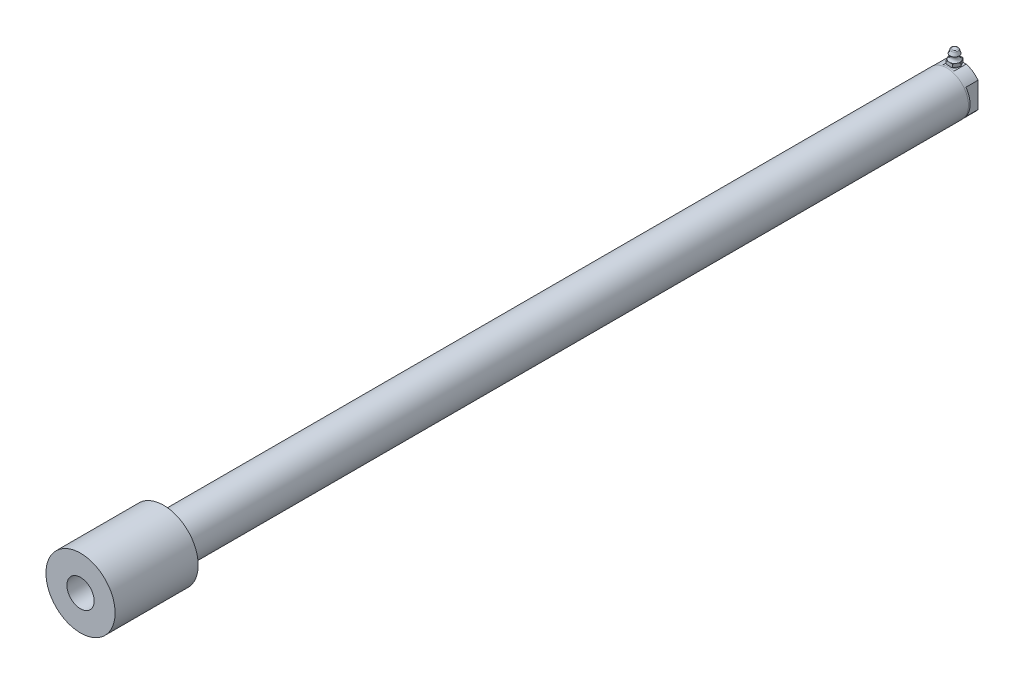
ISO-10303-21;
HEADER;
FILE_DESCRIPTION(('STEP AP214'),'2;1');
FILE_NAME('part.step','',(''),(''),'','','');
FILE_SCHEMA(('AUTOMOTIVE_DESIGN { 1 0 10303 214 1 1 1 1 }'));
ENDSEC;
DATA;
#1=APPLICATION_CONTEXT('core data for automotive mechanical design processes');
#2=APPLICATION_PROTOCOL_DEFINITION('international standard','automotive_design',2000,#1);
#3=PRODUCT_CONTEXT('',#1,'mechanical');
#4=PRODUCT('Part','Part','',(#3));
#5=PRODUCT_RELATED_PRODUCT_CATEGORY('part','',(#4));
#6=PRODUCT_DEFINITION_FORMATION('','',#4);
#7=PRODUCT_DEFINITION_CONTEXT('part definition',#1,'design');
#8=PRODUCT_DEFINITION('design','',#6,#7);
#9=PRODUCT_DEFINITION_SHAPE('','',#8);
#10=(LENGTH_UNIT() NAMED_UNIT(*) SI_UNIT(.MILLI.,.METRE.));
#11=(NAMED_UNIT(*) PLANE_ANGLE_UNIT() SI_UNIT($,.RADIAN.));
#12=(NAMED_UNIT(*) SI_UNIT($,.STERADIAN.) SOLID_ANGLE_UNIT());
#13=UNCERTAINTY_MEASURE_WITH_UNIT(LENGTH_MEASURE(1.E-05),#10,'distance_accuracy_value','');
#14=(GEOMETRIC_REPRESENTATION_CONTEXT(3) GLOBAL_UNCERTAINTY_ASSIGNED_CONTEXT((#13)) GLOBAL_UNIT_ASSIGNED_CONTEXT((#10,
#11,#12)) REPRESENTATION_CONTEXT('',''));
#15=CARTESIAN_POINT('',(0.,0.,0.));
#16=DIRECTION('',(0.,0.,1.));
#17=DIRECTION('',(1.,0.,0.));
#18=AXIS2_PLACEMENT_3D('',#15,#16,#17);
#19=CARTESIAN_POINT('',(0.,0.,10.16));
#20=DIRECTION('',(0.,0.,-1.));
#21=DIRECTION('',(-1.,0.,0.));
#22=AXIS2_PLACEMENT_3D('',#19,#20,#21);
#23=PLANE('',#22);
#24=CARTESIAN_POINT('',(0.,0.,10.16));
#25=DIRECTION('',(0.,0.,-1.));
#26=DIRECTION('',(-1.,0.,0.));
#27=AXIS2_PLACEMENT_3D('',#24,#25,#26);
#28=CIRCLE('',#27,15.8496);
#29=CARTESIAN_POINT('',(-15.8496,0.,10.16));
#30=VERTEX_POINT('',#29);
#31=EDGE_CURVE('E242',#30,#30,#28,.T.);
#32=ORIENTED_EDGE('',*,*,#31,.T.);
#33=EDGE_LOOP('',(#32));
#34=FACE_BOUND('',#33,.T.);
#35=CARTESIAN_POINT('',(0.,0.,10.16));
#36=DIRECTION('',(0.,0.,-1.));
#37=DIRECTION('',(0.,1.,0.));
#38=AXIS2_PLACEMENT_3D('',#35,#36,#37);
#39=CIRCLE('',#38,15.7607);
#40=CARTESIAN_POINT('',(0.,15.7607,10.16));
#41=VERTEX_POINT('',#40);
#42=EDGE_CURVE('E245',#41,#41,#39,.T.);
#43=ORIENTED_EDGE('',*,*,#42,.F.);
#44=EDGE_LOOP('',(#43));
#45=FACE_BOUND('',#44,.T.);
#46=ADVANCED_FACE('F16',(#34,#45),#23,.T.);
#47=CARTESIAN_POINT('',(0.,0.,585.2922));
#48=DIRECTION('',(0.,0.,1.));
#49=DIRECTION('',(1.,0.,0.));
#50=AXIS2_PLACEMENT_3D('',#47,#48,#49);
#51=PLANE('',#50);
#52=CARTESIAN_POINT('',(0.,0.,585.2922));
#53=DIRECTION('',(0.,0.,1.));
#54=DIRECTION('',(1.,0.,0.));
#55=AXIS2_PLACEMENT_3D('',#52,#53,#54);
#56=CIRCLE('',#55,15.8496);
#57=CARTESIAN_POINT('',(15.8496,0.,585.2922));
#58=VERTEX_POINT('',#57);
#59=EDGE_CURVE('E237',#58,#58,#56,.F.);
#60=ORIENTED_EDGE('',*,*,#59,.F.);
#61=EDGE_LOOP('',(#60));
#62=FACE_BOUND('',#61,.T.);
#63=CARTESIAN_POINT('',(0.,0.,585.2922));
#64=DIRECTION('',(0.,0.,1.));
#65=DIRECTION('',(1.,0.,0.));
#66=AXIS2_PLACEMENT_3D('',#63,#64,#65);
#67=CIRCLE('',#66,25.4);
#68=CARTESIAN_POINT('',(25.4,0.,585.2922));
#69=VERTEX_POINT('',#68);
#70=EDGE_CURVE('E233',#69,#69,#67,.T.);
#71=ORIENTED_EDGE('',*,*,#70,.F.);
#72=EDGE_LOOP('',(#71));
#73=FACE_BOUND('',#72,.T.);
#74=ADVANCED_FACE('F389',(#62,#73),#51,.F.);
#75=CARTESIAN_POINT('',(0.,0.,646.28014));
#76=DIRECTION('',(0.,0.,-1.));
#77=DIRECTION('',(-1.,0.,0.));
#78=AXIS2_PLACEMENT_3D('',#75,#76,#77);
#79=CYLINDRICAL_SURFACE('',#78,25.4);
#80=CARTESIAN_POINT('',(0.,0.,646.28014));
#81=DIRECTION('',(0.,0.,1.));
#82=DIRECTION('',(1.,0.,0.));
#83=AXIS2_PLACEMENT_3D('',#80,#81,#82);
#84=CIRCLE('',#83,25.4);
#85=CARTESIAN_POINT('',(25.4,0.,646.28014));
#86=VERTEX_POINT('',#85);
#87=EDGE_CURVE('E234',#86,#86,#84,.T.);
#88=ORIENTED_EDGE('',*,*,#87,.F.);
#89=EDGE_LOOP('',(#88));
#90=FACE_BOUND('',#89,.T.);
#91=ORIENTED_EDGE('',*,*,#70,.T.);
#92=EDGE_LOOP('',(#91));
#93=FACE_BOUND('',#92,.T.);
#94=ADVANCED_FACE('F387',(#90,#93),#79,.T.);
#95=CARTESIAN_POINT('',(0.,0.,646.28014));
#96=DIRECTION('',(0.,0.,1.));
#97=DIRECTION('',(1.,0.,0.));
#98=AXIS2_PLACEMENT_3D('',#95,#96,#97);
#99=PLANE('',#98);
#100=CARTESIAN_POINT('',(0.,0.,646.28014));
#101=DIRECTION('',(0.,0.,1.));
#102=DIRECTION('',(1.,0.,0.));
#103=AXIS2_PLACEMENT_3D('',#100,#101,#102);
#104=CIRCLE('',#103,10.);
#105=CARTESIAN_POINT('',(10.,0.,646.28014));
#106=VERTEX_POINT('',#105);
#107=EDGE_CURVE('E227',#106,#106,#104,.T.);
#108=ORIENTED_EDGE('',*,*,#107,.F.);
#109=EDGE_LOOP('',(#108));
#110=FACE_BOUND('',#109,.T.);
#111=ORIENTED_EDGE('',*,*,#87,.T.);
#112=EDGE_LOOP('',(#111));
#113=FACE_BOUND('',#112,.T.);
#114=ADVANCED_FACE('F384',(#110,#113),#99,.T.);
#115=CARTESIAN_POINT('',(0.,0.,585.2922));
#116=DIRECTION('',(0.,0.,-1.));
#117=DIRECTION('',(-1.,0.,0.));
#118=AXIS2_PLACEMENT_3D('',#115,#116,#117);
#119=CYLINDRICAL_SURFACE('',#118,15.8496);
#120=ORIENTED_EDGE('',*,*,#59,.T.);
#121=EDGE_LOOP('',(#120));
#122=FACE_BOUND('',#121,.T.);
#123=ORIENTED_EDGE('',*,*,#31,.F.);
#124=EDGE_LOOP('',(#123));
#125=FACE_BOUND('',#124,.T.);
#126=ADVANCED_FACE('F382',(#122,#125),#119,.T.);
#127=CARTESIAN_POINT('',(0.,0.,77.3303));
#128=DIRECTION('',(0.,0.,-1.));
#129=DIRECTION('',(-1.,0.,0.));
#130=AXIS2_PLACEMENT_3D('',#127,#128,#129);
#131=PLANE('',#130);
#132=CARTESIAN_POINT('',(0.,0.,77.3303));
#133=DIRECTION('',(0.,0.,-1.));
#134=DIRECTION('',(-1.,0.,0.));
#135=AXIS2_PLACEMENT_3D('',#132,#133,#134);
#136=CIRCLE('',#135,10.);
#137=CARTESIAN_POINT('',(-10.,0.,77.3303));
#138=VERTEX_POINT('',#137);
#139=EDGE_CURVE('E230',#138,#138,#136,.F.);
#140=ORIENTED_EDGE('',*,*,#139,.T.);
#141=EDGE_LOOP('',(#140));
#142=FACE_BOUND('',#141,.T.);
#143=ADVANCED_FACE('F378',(#142),#131,.F.);
#144=CARTESIAN_POINT('',(0.,0.,-18.1242712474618));
#145=DIRECTION('',(0.,0.,1.));
#146=DIRECTION('',(1.,0.,0.));
#147=AXIS2_PLACEMENT_3D('',#144,#145,#146);
#148=CYLINDRICAL_SURFACE('',#147,10.);
#149=ORIENTED_EDGE('',*,*,#107,.T.);
#150=EDGE_LOOP('',(#149));
#151=FACE_BOUND('',#150,.T.);
#152=ORIENTED_EDGE('',*,*,#139,.F.);
#153=EDGE_LOOP('',(#152));
#154=FACE_BOUND('',#153,.T.);
#155=ADVANCED_FACE('F375',(#151,#154),#148,.F.);
#156=CARTESIAN_POINT('',(0.,0.,32.512));
#157=DIRECTION('',(0.,0.,-1.));
#158=DIRECTION('',(0.,1.,0.));
#159=AXIS2_PLACEMENT_3D('',#156,#157,#158);
#160=CONICAL_SURFACE('',#159,4.96062,1.02974425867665);
#161=CARTESIAN_POINT('',(0.,0.,35.4926412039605));
#162=VERTEX_POINT('',#161);
#163=VERTEX_LOOP('',#162);
#164=FACE_BOUND('',#163,.T.);
#165=CARTESIAN_POINT('',(0.,0.,32.512));
#166=DIRECTION('',(0.,0.,-1.));
#167=DIRECTION('',(0.,1.,0.));
#168=AXIS2_PLACEMENT_3D('',#165,#166,#167);
#169=CIRCLE('',#168,4.96062);
#170=CARTESIAN_POINT('',(0.,4.96062,32.512));
#171=VERTEX_POINT('',#170);
#172=EDGE_CURVE('E280',#171,#171,#169,.T.);
#173=ORIENTED_EDGE('',*,*,#172,.T.);
#174=EDGE_LOOP('',(#173));
#175=FACE_BOUND('',#174,.T.);
#176=ADVANCED_FACE('F318',(#164,#175),#160,.F.);
#177=CARTESIAN_POINT('',(0.,0.,0.));
#178=DIRECTION('',(0.,0.,-1.));
#179=DIRECTION('',(0.,1.,0.));
#180=AXIS2_PLACEMENT_3D('',#177,#178,#179);
#181=CYLINDRICAL_SURFACE('',#180,4.96062);
#182=ORIENTED_EDGE('',*,*,#172,.F.);
#183=EDGE_LOOP('',(#182));
#184=FACE_BOUND('',#183,.T.);
#185=CARTESIAN_POINT('',(0.,0.,0.));
#186=DIRECTION('',(0.,0.,-1.));
#187=DIRECTION('',(0.,1.,0.));
#188=AXIS2_PLACEMENT_3D('',#185,#186,#187);
#189=CIRCLE('',#188,4.96062);
#190=CARTESIAN_POINT('',(0.,4.96062,0.));
#191=VERTEX_POINT('',#190);
#192=EDGE_CURVE('E284',#191,#191,#189,.T.);
#193=ORIENTED_EDGE('',*,*,#192,.T.);
#194=EDGE_LOOP('',(#193));
#195=FACE_BOUND('',#194,.T.);
#196=ADVANCED_FACE('F307',(#184,#195),#181,.F.);
#197=CARTESIAN_POINT('',(0.,0.,8.89));
#198=DIRECTION('',(0.,0.,-1.));
#199=DIRECTION('',(0.,1.,0.));
#200=AXIS2_PLACEMENT_3D('',#197,#198,#199);
#201=PLANE('',#200);
#202=CARTESIAN_POINT('',(0.,0.,8.89));
#203=DIRECTION('',(0.,0.,-1.));
#204=DIRECTION('',(0.,1.,0.));
#205=AXIS2_PLACEMENT_3D('',#202,#203,#204);
#206=CIRCLE('',#205,15.7607);
#207=CARTESIAN_POINT('',(12.7,9.33325583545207,8.89));
#208=VERTEX_POINT('',#207);
#209=CARTESIAN_POINT('',(12.7,-9.33325583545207,8.89));
#210=VERTEX_POINT('',#209);
#211=EDGE_CURVE('E269',#208,#210,#206,.T.);
#212=ORIENTED_EDGE('',*,*,#211,.T.);
#213=DIRECTION('',(0.,1.,0.));
#214=VECTOR('',#213,1.);
#215=CARTESIAN_POINT('',(12.7,-9.33325583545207,8.89));
#216=LINE('',#215,#214);
#217=EDGE_CURVE('E271',#210,#208,#216,.T.);
#218=ORIENTED_EDGE('',*,*,#217,.T.);
#219=EDGE_LOOP('',(#212,#218));
#220=FACE_BOUND('',#219,.T.);
#221=ADVANCED_FACE('F305',(#220),#201,.T.);
#222=CARTESIAN_POINT('',(12.7,-9.33325583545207,8.89));
#223=DIRECTION('',(-1.,0.,0.));
#224=DIRECTION('',(0.,0.,1.));
#225=AXIS2_PLACEMENT_3D('',#222,#223,#224);
#226=PLANE('',#225);
#227=DIRECTION('',(0.,1.,0.));
#228=VECTOR('',#227,1.);
#229=CARTESIAN_POINT('',(12.7,-9.33325583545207,0.));
#230=LINE('',#229,#228);
#231=CARTESIAN_POINT('',(12.7,-9.33325583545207,0.));
#232=VERTEX_POINT('',#231);
#233=CARTESIAN_POINT('',(12.7,9.33325583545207,0.));
#234=VERTEX_POINT('',#233);
#235=EDGE_CURVE('E267',#232,#234,#230,.T.);
#236=ORIENTED_EDGE('',*,*,#235,.T.);
#237=DIRECTION('',(0.,0.,-1.));
#238=VECTOR('',#237,1.);
#239=CARTESIAN_POINT('',(12.7,9.33325583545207,8.89));
#240=LINE('',#239,#238);
#241=EDGE_CURVE('E277',#208,#234,#240,.T.);
#242=ORIENTED_EDGE('',*,*,#241,.F.);
#243=ORIENTED_EDGE('',*,*,#217,.F.);
#244=DIRECTION('',(0.,0.,-1.));
#245=VECTOR('',#244,1.);
#246=CARTESIAN_POINT('',(12.7,-9.33325583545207,8.89));
#247=LINE('',#246,#245);
#248=EDGE_CURVE('E274',#210,#232,#247,.T.);
#249=ORIENTED_EDGE('',*,*,#248,.T.);
#250=EDGE_LOOP('',(#236,#242,#243,#249));
#251=FACE_BOUND('',#250,.T.);
#252=ADVANCED_FACE('F299',(#251),#226,.F.);
#253=CARTESIAN_POINT('',(0.,0.,8.89));
#254=DIRECTION('',(0.,0.,-1.));
#255=DIRECTION('',(0.,1.,0.));
#256=AXIS2_PLACEMENT_3D('',#253,#254,#255);
#257=PLANE('',#256);
#258=CARTESIAN_POINT('',(0.,0.,8.89));
#259=DIRECTION('',(0.,0.,-1.));
#260=DIRECTION('',(0.,1.,0.));
#261=AXIS2_PLACEMENT_3D('',#258,#259,#260);
#262=CIRCLE('',#261,15.7607);
#263=CARTESIAN_POINT('',(-12.7,-9.33325583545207,8.89));
#264=VERTEX_POINT('',#263);
#265=CARTESIAN_POINT('',(-12.7,9.33325583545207,8.89));
#266=VERTEX_POINT('',#265);
#267=EDGE_CURVE('E258',#264,#266,#262,.T.);
#268=ORIENTED_EDGE('',*,*,#267,.T.);
#269=DIRECTION('',(0.,-1.,0.));
#270=VECTOR('',#269,1.);
#271=CARTESIAN_POINT('',(-12.7,-9.33325583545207,8.89));
#272=LINE('',#271,#270);
#273=EDGE_CURVE('E260',#266,#264,#272,.T.);
#274=ORIENTED_EDGE('',*,*,#273,.T.);
#275=EDGE_LOOP('',(#268,#274));
#276=FACE_BOUND('',#275,.T.);
#277=ADVANCED_FACE('F316',(#276),#257,.T.);
#278=CARTESIAN_POINT('',(-12.7,-9.33325583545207,8.89));
#279=DIRECTION('',(1.,0.,0.));
#280=DIRECTION('',(0.,0.,-1.));
#281=AXIS2_PLACEMENT_3D('',#278,#279,#280);
#282=PLANE('',#281);
#283=DIRECTION('',(0.,-1.,0.));
#284=VECTOR('',#283,1.);
#285=CARTESIAN_POINT('',(-12.7,-9.33325583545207,0.));
#286=LINE('',#285,#284);
#287=CARTESIAN_POINT('',(-12.7,9.33325583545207,0.));
#288=VERTEX_POINT('',#287);
#289=CARTESIAN_POINT('',(-12.7,-9.33325583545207,0.));
#290=VERTEX_POINT('',#289);
#291=EDGE_CURVE('E255',#288,#290,#286,.T.);
#292=ORIENTED_EDGE('',*,*,#291,.T.);
#293=DIRECTION('',(0.,0.,-1.));
#294=VECTOR('',#293,1.);
#295=CARTESIAN_POINT('',(-12.7,-9.33325583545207,8.89));
#296=LINE('',#295,#294);
#297=EDGE_CURVE('E264',#264,#290,#296,.T.);
#298=ORIENTED_EDGE('',*,*,#297,.F.);
#299=ORIENTED_EDGE('',*,*,#273,.F.);
#300=DIRECTION('',(0.,0.,-1.));
#301=VECTOR('',#300,1.);
#302=CARTESIAN_POINT('',(-12.7,9.33325583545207,8.89));
#303=LINE('',#302,#301);
#304=EDGE_CURVE('E79',#266,#288,#303,.T.);
#305=ORIENTED_EDGE('',*,*,#304,.T.);
#306=EDGE_LOOP('',(#292,#298,#299,#305));
#307=FACE_BOUND('',#306,.T.);
#308=ADVANCED_FACE('F309',(#307),#282,.F.);
#309=CARTESIAN_POINT('',(0.,0.,0.));
#310=DIRECTION('',(0.,0.,-1.));
#311=DIRECTION('',(0.,1.,0.));
#312=AXIS2_PLACEMENT_3D('',#309,#310,#311);
#313=PLANE('',#312);
#314=DIRECTION('',(-1.,0.,0.));
#315=VECTOR('',#314,1.);
#316=CARTESIAN_POINT('',(4.01771881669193,15.24,0.));
#317=LINE('',#316,#315);
#318=CARTESIAN_POINT('',(4.01771881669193,15.24,0.));
#319=VERTEX_POINT('',#318);
#320=CARTESIAN_POINT('',(-4.01771881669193,15.24,0.));
#321=VERTEX_POINT('',#320);
#322=EDGE_CURVE('E252',#319,#321,#317,.T.);
#323=ORIENTED_EDGE('',*,*,#322,.F.);
#324=CARTESIAN_POINT('',(0.,0.,0.));
#325=DIRECTION('',(0.,0.,-1.));
#326=DIRECTION('',(0.,1.,0.));
#327=AXIS2_PLACEMENT_3D('',#324,#325,#326);
#328=CIRCLE('',#327,15.7607);
#329=EDGE_CURVE('E286',#319,#234,#328,.T.);
#330=ORIENTED_EDGE('',*,*,#329,.T.);
#331=ORIENTED_EDGE('',*,*,#235,.F.);
#332=EDGE_CURVE('E287',#232,#290,#328,.T.);
#333=ORIENTED_EDGE('',*,*,#332,.T.);
#334=ORIENTED_EDGE('',*,*,#291,.F.);
#335=EDGE_CURVE('E289',#288,#321,#328,.T.);
#336=ORIENTED_EDGE('',*,*,#335,.T.);
#337=EDGE_LOOP('',(#323,#330,#331,#333,#334,#336));
#338=FACE_BOUND('',#337,.T.);
#339=ORIENTED_EDGE('',*,*,#192,.F.);
#340=EDGE_LOOP('',(#339));
#341=FACE_BOUND('',#340,.T.);
#342=ADVANCED_FACE('F295',(#338,#341),#313,.T.);
#343=CARTESIAN_POINT('',(-4.01771881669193,15.24,8.89));
#344=DIRECTION('',(0.,0.,-1.));
#345=DIRECTION('',(0.,1.,0.));
#346=AXIS2_PLACEMENT_3D('',#343,#344,#345);
#347=PLANE('',#346);
#348=CARTESIAN_POINT('',(0.,0.,8.89));
#349=DIRECTION('',(0.,0.,-1.));
#350=DIRECTION('',(0.,1.,0.));
#351=AXIS2_PLACEMENT_3D('',#348,#349,#350);
#352=CIRCLE('',#351,15.7607);
#353=CARTESIAN_POINT('',(4.01771881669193,15.24,8.89));
#354=VERTEX_POINT('',#353);
#355=CARTESIAN_POINT('',(-4.01771881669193,15.24,8.89));
#356=VERTEX_POINT('',#355);
#357=EDGE_CURVE('E20',#354,#356,#352,.F.);
#358=ORIENTED_EDGE('',*,*,#357,.F.);
#359=DIRECTION('',(-1.,0.,0.));
#360=VECTOR('',#359,1.);
#361=CARTESIAN_POINT('',(4.01771881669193,15.24,8.89));
#362=LINE('',#361,#360);
#363=EDGE_CURVE('E248',#354,#356,#362,.T.);
#364=ORIENTED_EDGE('',*,*,#363,.T.);
#365=EDGE_LOOP('',(#358,#364));
#366=FACE_BOUND('',#365,.T.);
#367=ADVANCED_FACE('F402',(#366),#347,.T.);
#368=CARTESIAN_POINT('',(4.01771881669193,15.24,8.89));
#369=DIRECTION('',(0.,-1.,0.));
#370=DIRECTION('',(0.,0.,-1.));
#371=AXIS2_PLACEMENT_3D('',#368,#369,#370);
#372=PLANE('',#371);
#373=CARTESIAN_POINT('',(0.,15.24,4.445));
#374=DIRECTION('',(0.,-1.,0.));
#375=DIRECTION('',(1.,0.,0.));
#376=AXIS2_PLACEMENT_3D('',#373,#374,#375);
#377=CIRCLE('',#376,3.21504291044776);
#378=CARTESIAN_POINT('',(3.21504291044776,15.24,4.445));
#379=VERTEX_POINT('',#378);
#380=EDGE_CURVE('E10',#379,#379,#377,.F.);
#381=ORIENTED_EDGE('',*,*,#380,.F.);
#382=EDGE_LOOP('',(#381));
#383=FACE_BOUND('',#382,.T.);
#384=ORIENTED_EDGE('',*,*,#322,.T.);
#385=DIRECTION('',(0.,0.,-1.));
#386=VECTOR('',#385,1.);
#387=CARTESIAN_POINT('',(-4.01771881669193,15.24,8.89));
#388=LINE('',#387,#386);
#389=EDGE_CURVE('E251',#356,#321,#388,.T.);
#390=ORIENTED_EDGE('',*,*,#389,.F.);
#391=ORIENTED_EDGE('',*,*,#363,.F.);
#392=DIRECTION('',(0.,0.,-1.));
#393=VECTOR('',#392,1.);
#394=CARTESIAN_POINT('',(4.01771881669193,15.24,8.89));
#395=LINE('',#394,#393);
#396=EDGE_CURVE('E86',#354,#319,#395,.T.);
#397=ORIENTED_EDGE('',*,*,#396,.T.);
#398=EDGE_LOOP('',(#384,#390,#391,#397));
#399=FACE_BOUND('',#398,.T.);
#400=ADVANCED_FACE('F336',(#383,#399),#372,.F.);
#401=CARTESIAN_POINT('',(0.,0.,10.16));
#402=DIRECTION('',(0.,0.,-1.));
#403=DIRECTION('',(0.,1.,0.));
#404=AXIS2_PLACEMENT_3D('',#401,#402,#403);
#405=CYLINDRICAL_SURFACE('',#404,15.7607);
#406=ORIENTED_EDGE('',*,*,#396,.F.);
#407=ORIENTED_EDGE('',*,*,#357,.T.);
#408=ORIENTED_EDGE('',*,*,#389,.T.);
#409=ORIENTED_EDGE('',*,*,#335,.F.);
#410=ORIENTED_EDGE('',*,*,#304,.F.);
#411=ORIENTED_EDGE('',*,*,#267,.F.);
#412=ORIENTED_EDGE('',*,*,#297,.T.);
#413=ORIENTED_EDGE('',*,*,#332,.F.);
#414=ORIENTED_EDGE('',*,*,#248,.F.);
#415=ORIENTED_EDGE('',*,*,#211,.F.);
#416=ORIENTED_EDGE('',*,*,#241,.T.);
#417=ORIENTED_EDGE('',*,*,#329,.F.);
#418=EDGE_LOOP('',(#406,#407,#408,#409,#410,#411,#412,#413,#414,#415,#416,#417));
#419=FACE_BOUND('',#418,.T.);
#420=ORIENTED_EDGE('',*,*,#42,.T.);
#421=EDGE_LOOP('',(#420));
#422=FACE_BOUND('',#421,.T.);
#423=ADVANCED_FACE('F18',(#419,#422),#405,.T.);
#424=CARTESIAN_POINT('',(0.,25.4,4.445));
#425=DIRECTION('',(0.,1.,0.));
#426=DIRECTION('',(0.,0.,1.));
#427=AXIS2_PLACEMENT_3D('',#424,#425,#426);
#428=PLANE('',#427);
#429=CARTESIAN_POINT('',(0.,25.4,4.445));
#430=DIRECTION('',(0.,1.,0.));
#431=DIRECTION('',(0.,0.,1.));
#432=AXIS2_PLACEMENT_3D('',#429,#430,#431);
#433=CIRCLE('',#432,1.7474960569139);
#434=CARTESIAN_POINT('',(0.,25.4,6.1924960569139));
#435=VERTEX_POINT('',#434);
#436=EDGE_CURVE('E26',#435,#435,#433,.T.);
#437=ORIENTED_EDGE('',*,*,#436,.T.);
#438=EDGE_LOOP('',(#437));
#439=FACE_BOUND('',#438,.T.);
#440=ADVANCED_FACE('F323',(#439),#428,.T.);
#441=CARTESIAN_POINT('',(0.,24.638,4.445));
#442=DIRECTION('',(0.,1.,0.));
#443=DIRECTION('',(0.,0.,1.));
#444=AXIS2_PLACEMENT_3D('',#441,#442,#443);
#445=TOROIDAL_SURFACE('',#444,1.7474960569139,0.762);
#446=ORIENTED_EDGE('',*,*,#436,.F.);
#447=EDGE_LOOP('',(#446));
#448=FACE_BOUND('',#447,.T.);
#449=CARTESIAN_POINT('',(0.,24.8923915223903,4.445));
#450=DIRECTION('',(0.,1.,0.));
#451=DIRECTION('',(0.,0.,1.));
#452=AXIS2_PLACEMENT_3D('',#449,#450,#451);
#453=CIRCLE('',#452,2.46577800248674);
#454=CARTESIAN_POINT('',(0.,24.8923915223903,6.91077800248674));
#455=VERTEX_POINT('',#454);
#456=EDGE_CURVE('E222',#455,#455,#453,.F.);
#457=ORIENTED_EDGE('',*,*,#456,.F.);
#458=EDGE_LOOP('',(#457));
#459=FACE_BOUND('',#458,.T.);
#460=ADVANCED_FACE('F325',(#448,#459),#445,.T.);
#461=CARTESIAN_POINT('',(0.,22.352,4.445));
#462=DIRECTION('',(0.,-1.,0.));
#463=DIRECTION('',(0.,0.,-1.));
#464=AXIS2_PLACEMENT_3D('',#461,#462,#463);
#465=CONICAL_SURFACE('',#464,3.3655,0.340381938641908);
#466=ORIENTED_EDGE('',*,*,#456,.T.);
#467=EDGE_LOOP('',(#466));
#468=FACE_BOUND('',#467,.T.);
#469=CARTESIAN_POINT('',(0.,22.352,4.445));
#470=DIRECTION('',(0.,-1.,0.));
#471=DIRECTION('',(0.,0.,-1.));
#472=AXIS2_PLACEMENT_3D('',#469,#470,#471);
#473=CIRCLE('',#472,3.3655);
#474=CARTESIAN_POINT('',(0.,22.352,1.0795));
#475=VERTEX_POINT('',#474);
#476=EDGE_CURVE('E175',#475,#475,#473,.T.);
#477=ORIENTED_EDGE('',*,*,#476,.F.);
#478=EDGE_LOOP('',(#477));
#479=FACE_BOUND('',#478,.T.);
#480=ADVANCED_FACE('F333',(#468,#479),#465,.T.);
#481=CARTESIAN_POINT('',(0.,20.7536902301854,4.445));
#482=DIRECTION('',(0.,-1.,0.));
#483=DIRECTION('',(0.,0.,-1.));
#484=AXIS2_PLACEMENT_3D('',#481,#482,#483);
#485=TOROIDAL_SURFACE('',#484,5.20693450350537,2.43833450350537);
#486=ORIENTED_EDGE('',*,*,#476,.T.);
#487=EDGE_LOOP('',(#486));
#488=FACE_BOUND('',#487,.T.);
#489=CARTESIAN_POINT('',(0.,18.653125,4.445));
#490=DIRECTION('',(0.,-1.,0.));
#491=DIRECTION('',(0.,0.,-1.));
#492=AXIS2_PLACEMENT_3D('',#489,#490,#491);
#493=CIRCLE('',#492,3.96875);
#494=CARTESIAN_POINT('',(0.,18.653125,0.47625));
#495=VERTEX_POINT('',#494);
#496=CARTESIAN_POINT('',(3.43703832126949,18.653125,2.460625));
#497=VERTEX_POINT('',#496);
#498=EDGE_CURVE('E35',#495,#497,#493,.T.);
#499=ORIENTED_EDGE('',*,*,#498,.F.);
#500=CARTESIAN_POINT('',(-3.43703832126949,18.653125,2.460625));
#501=VERTEX_POINT('',#500);
#502=EDGE_CURVE('E171',#501,#495,#493,.T.);
#503=ORIENTED_EDGE('',*,*,#502,.F.);
#504=CARTESIAN_POINT('',(-3.43703832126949,18.653125,6.429375));
#505=VERTEX_POINT('',#504);
#506=EDGE_CURVE('E170',#505,#501,#493,.T.);
#507=ORIENTED_EDGE('',*,*,#506,.F.);
#508=CARTESIAN_POINT('',(0.,18.653125,8.41375));
#509=VERTEX_POINT('',#508);
#510=EDGE_CURVE('E150',#509,#505,#493,.T.);
#511=ORIENTED_EDGE('',*,*,#510,.F.);
#512=CARTESIAN_POINT('',(3.43703832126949,18.653125,6.429375));
#513=VERTEX_POINT('',#512);
#514=EDGE_CURVE('E139',#513,#509,#493,.T.);
#515=ORIENTED_EDGE('',*,*,#514,.F.);
#516=EDGE_CURVE('E149',#497,#513,#493,.T.);
#517=ORIENTED_EDGE('',*,*,#516,.F.);
#518=EDGE_LOOP('',(#499,#503,#507,#511,#515,#517));
#519=FACE_BOUND('',#518,.T.);
#520=ADVANCED_FACE('F168',(#488,#519),#485,.F.);
#521=CARTESIAN_POINT('',(-2.29135888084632,18.653125,0.47625));
#522=DIRECTION('',(0.,1.,0.));
#523=DIRECTION('',(1.,0.,0.));
#524=AXIS2_PLACEMENT_3D('',#521,#522,#523);
#525=PLANE('',#524);
#526=ORIENTED_EDGE('',*,*,#506,.T.);
#527=DIRECTION('',(-0.5,0.,0.866025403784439));
#528=VECTOR('',#527,1.);
#529=CARTESIAN_POINT('',(-2.29135888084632,18.653125,0.47625));
#530=LINE('',#529,#528);
#531=CARTESIAN_POINT('',(-4.58271776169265,18.653125,4.445));
#532=VERTEX_POINT('',#531);
#533=EDGE_CURVE('E184',#501,#532,#530,.T.);
#534=ORIENTED_EDGE('',*,*,#533,.T.);
#535=DIRECTION('',(0.5,0.,0.866025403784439));
#536=VECTOR('',#535,1.);
#537=CARTESIAN_POINT('',(-4.58271776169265,18.653125,4.445));
#538=LINE('',#537,#536);
#539=EDGE_CURVE('E95',#532,#505,#538,.T.);
#540=ORIENTED_EDGE('',*,*,#539,.T.);
#541=EDGE_LOOP('',(#526,#534,#540));
#542=FACE_BOUND('',#541,.T.);
#543=ADVANCED_FACE('F344',(#542),#525,.T.);
#544=ORIENTED_EDGE('',*,*,#510,.T.);
#545=CARTESIAN_POINT('',(-2.29135888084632,18.653125,8.41375));
#546=VERTEX_POINT('',#545);
#547=EDGE_CURVE('E165',#505,#546,#538,.T.);
#548=ORIENTED_EDGE('',*,*,#547,.T.);
#549=DIRECTION('',(1.,0.,0.));
#550=VECTOR('',#549,1.);
#551=CARTESIAN_POINT('',(-2.29135888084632,18.653125,8.41375));
#552=LINE('',#551,#550);
#553=EDGE_CURVE('E157',#546,#509,#552,.T.);
#554=ORIENTED_EDGE('',*,*,#553,.T.);
#555=EDGE_LOOP('',(#544,#548,#554));
#556=FACE_BOUND('',#555,.T.);
#557=ADVANCED_FACE('F163',(#556),#525,.T.);
#558=ORIENTED_EDGE('',*,*,#514,.T.);
#559=CARTESIAN_POINT('',(2.29135888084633,18.653125,8.41375));
#560=VERTEX_POINT('',#559);
#561=EDGE_CURVE('E142',#509,#560,#552,.T.);
#562=ORIENTED_EDGE('',*,*,#561,.T.);
#563=DIRECTION('',(0.5,0.,-0.866025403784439));
#564=VECTOR('',#563,1.);
#565=CARTESIAN_POINT('',(2.29135888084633,18.653125,8.41375));
#566=LINE('',#565,#564);
#567=EDGE_CURVE('E145',#560,#513,#566,.T.);
#568=ORIENTED_EDGE('',*,*,#567,.T.);
#569=EDGE_LOOP('',(#558,#562,#568));
#570=FACE_BOUND('',#569,.T.);
#571=ADVANCED_FACE('F141',(#570),#525,.T.);
#572=ORIENTED_EDGE('',*,*,#516,.T.);
#573=CARTESIAN_POINT('',(4.58271776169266,18.653125,4.445));
#574=VERTEX_POINT('',#573);
#575=EDGE_CURVE('E167',#513,#574,#566,.T.);
#576=ORIENTED_EDGE('',*,*,#575,.T.);
#577=DIRECTION('',(-0.5,0.,-0.866025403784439));
#578=VECTOR('',#577,1.);
#579=CARTESIAN_POINT('',(4.58271776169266,18.653125,4.445));
#580=LINE('',#579,#578);
#581=EDGE_CURVE('E192',#574,#497,#580,.T.);
#582=ORIENTED_EDGE('',*,*,#581,.T.);
#583=EDGE_LOOP('',(#572,#576,#582));
#584=FACE_BOUND('',#583,.T.);
#585=ADVANCED_FACE('F651',(#584),#525,.T.);
#586=ORIENTED_EDGE('',*,*,#498,.T.);
#587=CARTESIAN_POINT('',(2.29135888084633,18.653125,0.47625));
#588=VERTEX_POINT('',#587);
#589=EDGE_CURVE('E191',#497,#588,#580,.T.);
#590=ORIENTED_EDGE('',*,*,#589,.T.);
#591=DIRECTION('',(-1.,0.,0.));
#592=VECTOR('',#591,1.);
#593=CARTESIAN_POINT('',(2.29135888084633,18.653125,0.47625));
#594=LINE('',#593,#592);
#595=EDGE_CURVE('E182',#588,#495,#594,.T.);
#596=ORIENTED_EDGE('',*,*,#595,.T.);
#597=EDGE_LOOP('',(#586,#590,#596));
#598=FACE_BOUND('',#597,.T.);
#599=ADVANCED_FACE('F658',(#598),#525,.T.);
#600=ORIENTED_EDGE('',*,*,#502,.T.);
#601=CARTESIAN_POINT('',(-2.29135888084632,18.653125,0.47625));
#602=VERTEX_POINT('',#601);
#603=EDGE_CURVE('E185',#495,#602,#594,.T.);
#604=ORIENTED_EDGE('',*,*,#603,.T.);
#605=EDGE_CURVE('E186',#602,#501,#530,.T.);
#606=ORIENTED_EDGE('',*,*,#605,.T.);
#607=EDGE_LOOP('',(#600,#604,#606));
#608=FACE_BOUND('',#607,.T.);
#609=ADVANCED_FACE('F347',(#608),#525,.T.);
#610=CARTESIAN_POINT('',(-2.29135888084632,18.653125,0.47625));
#611=DIRECTION('',(0.866025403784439,0.,0.5));
#612=DIRECTION('',(0.5,0.,-0.866025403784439));
#613=AXIS2_PLACEMENT_3D('',#610,#611,#612);
#614=PLANE('',#613);
#615=DIRECTION('',(-0.5,0.,0.866025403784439));
#616=VECTOR('',#615,1.);
#617=CARTESIAN_POINT('',(-2.29135888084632,16.271875,0.47625));
#618=LINE('',#617,#616);
#619=CARTESIAN_POINT('',(-2.29135888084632,16.271875,0.47625));
#620=VERTEX_POINT('',#619);
#621=CARTESIAN_POINT('',(-4.58271776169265,16.271875,4.445));
#622=VERTEX_POINT('',#621);
#623=EDGE_CURVE('E198',#620,#622,#618,.T.);
#624=ORIENTED_EDGE('',*,*,#623,.T.);
#625=DIRECTION('',(0.,-1.,0.));
#626=VECTOR('',#625,1.);
#627=CARTESIAN_POINT('',(-4.58271776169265,18.653125,4.445));
#628=LINE('',#627,#626);
#629=EDGE_CURVE('E216',#532,#622,#628,.T.);
#630=ORIENTED_EDGE('',*,*,#629,.F.);
#631=ORIENTED_EDGE('',*,*,#533,.F.);
#632=ORIENTED_EDGE('',*,*,#605,.F.);
#633=DIRECTION('',(0.,-1.,0.));
#634=VECTOR('',#633,1.);
#635=CARTESIAN_POINT('',(-2.29135888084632,18.653125,0.47625));
#636=LINE('',#635,#634);
#637=EDGE_CURVE('E219',#602,#620,#636,.T.);
#638=ORIENTED_EDGE('',*,*,#637,.T.);
#639=EDGE_LOOP('',(#624,#630,#631,#632,#638));
#640=FACE_BOUND('',#639,.T.);
#641=ADVANCED_FACE('F367',(#640),#614,.F.);
#642=CARTESIAN_POINT('',(-4.58271776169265,18.653125,4.445));
#643=DIRECTION('',(0.866025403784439,0.,-0.5));
#644=DIRECTION('',(-0.5,0.,-0.866025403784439));
#645=AXIS2_PLACEMENT_3D('',#642,#643,#644);
#646=PLANE('',#645);
#647=DIRECTION('',(0.5,0.,0.866025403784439));
#648=VECTOR('',#647,1.);
#649=CARTESIAN_POINT('',(-4.58271776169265,16.271875,4.445));
#650=LINE('',#649,#648);
#651=CARTESIAN_POINT('',(-2.29135888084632,16.271875,8.41375));
#652=VERTEX_POINT('',#651);
#653=EDGE_CURVE('E200',#622,#652,#650,.T.);
#654=ORIENTED_EDGE('',*,*,#653,.T.);
#655=DIRECTION('',(0.,-1.,0.));
#656=VECTOR('',#655,1.);
#657=CARTESIAN_POINT('',(-2.29135888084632,18.653125,8.41375));
#658=LINE('',#657,#656);
#659=EDGE_CURVE('E214',#546,#652,#658,.T.);
#660=ORIENTED_EDGE('',*,*,#659,.F.);
#661=ORIENTED_EDGE('',*,*,#547,.F.);
#662=ORIENTED_EDGE('',*,*,#539,.F.);
#663=ORIENTED_EDGE('',*,*,#629,.T.);
#664=EDGE_LOOP('',(#654,#660,#661,#662,#663));
#665=FACE_BOUND('',#664,.T.);
#666=ADVANCED_FACE('F364',(#665),#646,.F.);
#667=CARTESIAN_POINT('',(-2.29135888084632,18.653125,8.41375));
#668=DIRECTION('',(0.,0.,-1.));
#669=DIRECTION('',(-1.,0.,0.));
#670=AXIS2_PLACEMENT_3D('',#667,#668,#669);
#671=PLANE('',#670);
#672=DIRECTION('',(1.,0.,0.));
#673=VECTOR('',#672,1.);
#674=CARTESIAN_POINT('',(-2.29135888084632,16.271875,8.41375));
#675=LINE('',#674,#673);
#676=CARTESIAN_POINT('',(2.29135888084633,16.271875,8.41375));
#677=VERTEX_POINT('',#676);
#678=EDGE_CURVE('E202',#652,#677,#675,.T.);
#679=ORIENTED_EDGE('',*,*,#678,.T.);
#680=DIRECTION('',(0.,-1.,0.));
#681=VECTOR('',#680,1.);
#682=CARTESIAN_POINT('',(2.29135888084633,18.653125,8.41375));
#683=LINE('',#682,#681);
#684=EDGE_CURVE('E159',#560,#677,#683,.T.);
#685=ORIENTED_EDGE('',*,*,#684,.F.);
#686=ORIENTED_EDGE('',*,*,#561,.F.);
#687=ORIENTED_EDGE('',*,*,#553,.F.);
#688=ORIENTED_EDGE('',*,*,#659,.T.);
#689=EDGE_LOOP('',(#679,#685,#686,#687,#688));
#690=FACE_BOUND('',#689,.T.);
#691=ADVANCED_FACE('F155',(#690),#671,.F.);
#692=CARTESIAN_POINT('',(2.29135888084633,18.653125,8.41375));
#693=DIRECTION('',(-0.866025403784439,0.,-0.5));
#694=DIRECTION('',(-0.5,0.,0.866025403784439));
#695=AXIS2_PLACEMENT_3D('',#692,#693,#694);
#696=PLANE('',#695);
#697=DIRECTION('',(0.5,0.,-0.866025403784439));
#698=VECTOR('',#697,1.);
#699=CARTESIAN_POINT('',(2.29135888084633,16.271875,8.41375));
#700=LINE('',#699,#698);
#701=CARTESIAN_POINT('',(4.58271776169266,16.271875,4.445));
#702=VERTEX_POINT('',#701);
#703=EDGE_CURVE('E204',#677,#702,#700,.T.);
#704=ORIENTED_EDGE('',*,*,#703,.T.);
#705=DIRECTION('',(0.,-1.,0.));
#706=VECTOR('',#705,1.);
#707=CARTESIAN_POINT('',(4.58271776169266,18.653125,4.445));
#708=LINE('',#707,#706);
#709=EDGE_CURVE('E210',#574,#702,#708,.T.);
#710=ORIENTED_EDGE('',*,*,#709,.F.);
#711=ORIENTED_EDGE('',*,*,#575,.F.);
#712=ORIENTED_EDGE('',*,*,#567,.F.);
#713=ORIENTED_EDGE('',*,*,#684,.T.);
#714=EDGE_LOOP('',(#704,#710,#711,#712,#713));
#715=FACE_BOUND('',#714,.T.);
#716=ADVANCED_FACE('F357',(#715),#696,.F.);
#717=CARTESIAN_POINT('',(4.58271776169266,18.653125,4.445));
#718=DIRECTION('',(-0.866025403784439,0.,0.5));
#719=DIRECTION('',(0.5,0.,0.866025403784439));
#720=AXIS2_PLACEMENT_3D('',#717,#718,#719);
#721=PLANE('',#720);
#722=DIRECTION('',(-0.5,0.,-0.866025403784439));
#723=VECTOR('',#722,1.);
#724=CARTESIAN_POINT('',(4.58271776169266,16.271875,4.445));
#725=LINE('',#724,#723);
#726=CARTESIAN_POINT('',(2.29135888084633,16.271875,0.47625));
#727=VERTEX_POINT('',#726);
#728=EDGE_CURVE('E206',#702,#727,#725,.T.);
#729=ORIENTED_EDGE('',*,*,#728,.T.);
#730=DIRECTION('',(0.,-1.,0.));
#731=VECTOR('',#730,1.);
#732=CARTESIAN_POINT('',(2.29135888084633,18.653125,0.47625));
#733=LINE('',#732,#731);
#734=EDGE_CURVE('E195',#588,#727,#733,.T.);
#735=ORIENTED_EDGE('',*,*,#734,.F.);
#736=ORIENTED_EDGE('',*,*,#589,.F.);
#737=ORIENTED_EDGE('',*,*,#581,.F.);
#738=ORIENTED_EDGE('',*,*,#709,.T.);
#739=EDGE_LOOP('',(#729,#735,#736,#737,#738));
#740=FACE_BOUND('',#739,.T.);
#741=ADVANCED_FACE('F354',(#740),#721,.F.);
#742=CARTESIAN_POINT('',(2.29135888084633,18.653125,0.47625));
#743=DIRECTION('',(0.,0.,1.));
#744=DIRECTION('',(0.,-1.,0.));
#745=AXIS2_PLACEMENT_3D('',#742,#743,#744);
#746=PLANE('',#745);
#747=DIRECTION('',(-1.,0.,0.));
#748=VECTOR('',#747,1.);
#749=CARTESIAN_POINT('',(2.29135888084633,16.271875,0.47625));
#750=LINE('',#749,#748);
#751=EDGE_CURVE('E181',#727,#620,#750,.T.);
#752=ORIENTED_EDGE('',*,*,#751,.T.);
#753=ORIENTED_EDGE('',*,*,#637,.F.);
#754=ORIENTED_EDGE('',*,*,#603,.F.);
#755=ORIENTED_EDGE('',*,*,#595,.F.);
#756=ORIENTED_EDGE('',*,*,#734,.T.);
#757=EDGE_LOOP('',(#752,#753,#754,#755,#756));
#758=FACE_BOUND('',#757,.T.);
#759=ADVANCED_FACE('F352',(#758),#746,.F.);
#760=CARTESIAN_POINT('',(-2.29135888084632,16.271875,0.47625));
#761=DIRECTION('',(0.,1.,0.));
#762=DIRECTION('',(1.,0.,0.));
#763=AXIS2_PLACEMENT_3D('',#760,#761,#762);
#764=PLANE('',#763);
#765=CARTESIAN_POINT('',(0.,16.271875,4.445));
#766=DIRECTION('',(0.,-1.,0.));
#767=DIRECTION('',(0.,0.,-1.));
#768=AXIS2_PLACEMENT_3D('',#765,#766,#767);
#769=CIRCLE('',#768,3.2385);
#770=CARTESIAN_POINT('',(0.,16.271875,1.2065));
#771=VERTEX_POINT('',#770);
#772=EDGE_CURVE('E174',#771,#771,#769,.T.);
#773=ORIENTED_EDGE('',*,*,#772,.F.);
#774=EDGE_LOOP('',(#773));
#775=FACE_BOUND('',#774,.T.);
#776=ORIENTED_EDGE('',*,*,#751,.F.);
#777=ORIENTED_EDGE('',*,*,#728,.F.);
#778=ORIENTED_EDGE('',*,*,#703,.F.);
#779=ORIENTED_EDGE('',*,*,#678,.F.);
#780=ORIENTED_EDGE('',*,*,#653,.F.);
#781=ORIENTED_EDGE('',*,*,#623,.F.);
#782=EDGE_LOOP('',(#776,#777,#778,#779,#780,#781));
#783=FACE_BOUND('',#782,.T.);
#784=ADVANCED_FACE('F348',(#775,#783),#764,.F.);
#785=CARTESIAN_POINT('',(0.,16.271875,4.445));
#786=DIRECTION('',(0.,-1.,0.));
#787=DIRECTION('',(0.,0.,-1.));
#788=AXIS2_PLACEMENT_3D('',#785,#786,#787);
#789=CYLINDRICAL_SURFACE('',#788,3.2385);
#790=ORIENTED_EDGE('',*,*,#772,.T.);
#791=EDGE_LOOP('',(#790));
#792=FACE_BOUND('',#791,.T.);
#793=CARTESIAN_POINT('',(0.,15.763875,4.445));
#794=DIRECTION('',(0.,-1.,0.));
#795=DIRECTION('',(0.,0.,-1.));
#796=AXIS2_PLACEMENT_3D('',#793,#794,#795);
#797=CIRCLE('',#796,3.2385);
#798=CARTESIAN_POINT('',(0.,15.763875,1.2065));
#799=VERTEX_POINT('',#798);
#800=EDGE_CURVE('E178',#799,#799,#797,.T.);
#801=ORIENTED_EDGE('',*,*,#800,.F.);
#802=EDGE_LOOP('',(#801));
#803=FACE_BOUND('',#802,.T.);
#804=ADVANCED_FACE('F351',(#792,#803),#789,.T.);
#805=CARTESIAN_POINT('',(0.,11.509375,4.445));
#806=DIRECTION('',(0.,1.,0.));
#807=DIRECTION('',(0.,0.,1.));
#808=AXIS2_PLACEMENT_3D('',#805,#806,#807);
#809=CONICAL_SURFACE('',#808,3.048,0.0447462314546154);
#810=ORIENTED_EDGE('',*,*,#800,.T.);
#811=EDGE_LOOP('',(#810));
#812=FACE_BOUND('',#811,.T.);
#813=ORIENTED_EDGE('',*,*,#380,.T.);
#814=EDGE_LOOP('',(#813));
#815=FACE_BOUND('',#814,.T.);
#816=ADVANCED_FACE('F339',(#812,#815),#809,.T.);
#817=CLOSED_SHELL('',(#46,#74,#94,#114,#126,#143,#155,#176,#196,#221,#252,#277,#308,#342,#367,
#400,#423,#440,#460,#480,#520,#543,#557,#571,#585,#599,#609,#641,#666,#691,#716,#741,#759,#784,
#804,#816));
#818=MANIFOLD_SOLID_BREP('B1',#817);
#819=ADVANCED_BREP_SHAPE_REPRESENTATION('',(#18,#818),#14);
#820=SHAPE_DEFINITION_REPRESENTATION(#9,#819);
ENDSEC;
END-ISO-10303-21;
